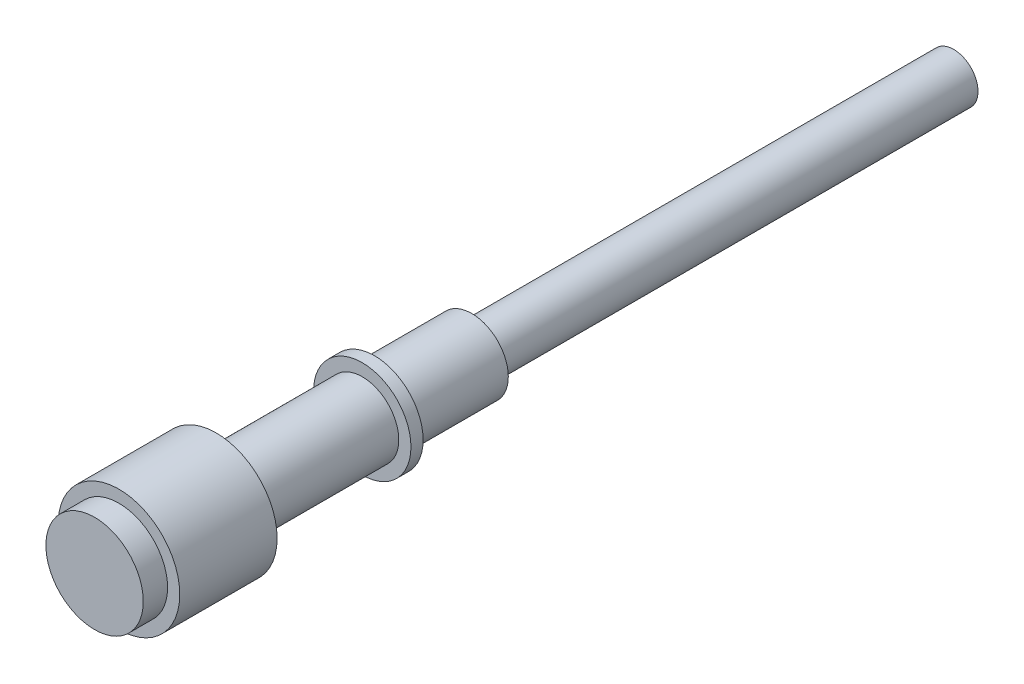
ISO-10303-21;
HEADER;
FILE_DESCRIPTION(('STEP AP214'),'2;1');
FILE_NAME('part.step','',(''),(''),'','','');
FILE_SCHEMA(('AUTOMOTIVE_DESIGN { 1 0 10303 214 1 1 1 1 }'));
ENDSEC;
DATA;
#1=APPLICATION_CONTEXT('core data for automotive mechanical design processes');
#2=APPLICATION_PROTOCOL_DEFINITION('international standard','automotive_design',2000,#1);
#3=PRODUCT_CONTEXT('',#1,'mechanical');
#4=PRODUCT('Part','Part','',(#3));
#5=PRODUCT_RELATED_PRODUCT_CATEGORY('part','',(#4));
#6=PRODUCT_DEFINITION_FORMATION('','',#4);
#7=PRODUCT_DEFINITION_CONTEXT('part definition',#1,'design');
#8=PRODUCT_DEFINITION('design','',#6,#7);
#9=PRODUCT_DEFINITION_SHAPE('','',#8);
#10=(LENGTH_UNIT() NAMED_UNIT(*) SI_UNIT(.MILLI.,.METRE.));
#11=(NAMED_UNIT(*) PLANE_ANGLE_UNIT() SI_UNIT($,.RADIAN.));
#12=(NAMED_UNIT(*) SI_UNIT($,.STERADIAN.) SOLID_ANGLE_UNIT());
#13=UNCERTAINTY_MEASURE_WITH_UNIT(LENGTH_MEASURE(1.E-05),#10,'distance_accuracy_value','');
#14=(GEOMETRIC_REPRESENTATION_CONTEXT(3) GLOBAL_UNCERTAINTY_ASSIGNED_CONTEXT((#13)) GLOBAL_UNIT_ASSIGNED_CONTEXT((#10,
#11,#12)) REPRESENTATION_CONTEXT('',''));
#15=CARTESIAN_POINT('',(0.,0.,0.));
#16=DIRECTION('',(0.,0.,1.));
#17=DIRECTION('',(1.,0.,0.));
#18=AXIS2_PLACEMENT_3D('',#15,#16,#17);
#19=CARTESIAN_POINT('',(0.,0.,125.73));
#20=DIRECTION('',(0.,0.,-1.));
#21=DIRECTION('',(-1.,0.,0.));
#22=AXIS2_PLACEMENT_3D('',#19,#20,#21);
#23=CYLINDRICAL_SURFACE('',#22,6.35);
#24=CARTESIAN_POINT('',(0.,0.,125.73));
#25=DIRECTION('',(0.,0.,1.));
#26=DIRECTION('',(1.,0.,0.));
#27=AXIS2_PLACEMENT_3D('',#24,#25,#26);
#28=CIRCLE('',#27,6.35);
#29=CARTESIAN_POINT('',(6.35,0.,125.73));
#30=VERTEX_POINT('',#29);
#31=EDGE_CURVE('E55',#30,#30,#28,.T.);
#32=ORIENTED_EDGE('',*,*,#31,.F.);
#33=EDGE_LOOP('',(#32));
#34=FACE_BOUND('',#33,.T.);
#35=CARTESIAN_POINT('',(0.,0.,0.));
#36=DIRECTION('',(0.,0.,1.));
#37=DIRECTION('',(1.,0.,0.));
#38=AXIS2_PLACEMENT_3D('',#35,#36,#37);
#39=CIRCLE('',#38,6.35);
#40=CARTESIAN_POINT('',(6.35,0.,0.));
#41=VERTEX_POINT('',#40);
#42=EDGE_CURVE('E46',#41,#41,#39,.T.);
#43=ORIENTED_EDGE('',*,*,#42,.T.);
#44=EDGE_LOOP('',(#43));
#45=FACE_BOUND('',#44,.T.);
#46=ADVANCED_FACE('F43',(#34,#45),#23,.T.);
#47=CARTESIAN_POINT('',(0.,0.,0.));
#48=DIRECTION('',(0.,0.,1.));
#49=DIRECTION('',(1.,0.,0.));
#50=AXIS2_PLACEMENT_3D('',#47,#48,#49);
#51=PLANE('',#50);
#52=ORIENTED_EDGE('',*,*,#42,.F.);
#53=EDGE_LOOP('',(#52));
#54=FACE_BOUND('',#53,.T.);
#55=ADVANCED_FACE('F87',(#54),#51,.F.);
#56=CARTESIAN_POINT('',(0.,0.,151.13));
#57=DIRECTION('',(0.,0.,-1.));
#58=DIRECTION('',(-1.,0.,0.));
#59=AXIS2_PLACEMENT_3D('',#56,#57,#58);
#60=CYLINDRICAL_SURFACE('',#59,9.525);
#61=CARTESIAN_POINT('',(0.,0.,151.13));
#62=DIRECTION('',(0.,0.,1.));
#63=DIRECTION('',(1.,0.,0.));
#64=AXIS2_PLACEMENT_3D('',#61,#62,#63);
#65=CIRCLE('',#64,9.525);
#66=CARTESIAN_POINT('',(9.525,0.,151.13));
#67=VERTEX_POINT('',#66);
#68=EDGE_CURVE('E76',#67,#67,#65,.T.);
#69=ORIENTED_EDGE('',*,*,#68,.F.);
#70=EDGE_LOOP('',(#69));
#71=FACE_BOUND('',#70,.T.);
#72=CARTESIAN_POINT('',(0.,0.,125.73));
#73=DIRECTION('',(0.,0.,1.));
#74=DIRECTION('',(1.,0.,0.));
#75=AXIS2_PLACEMENT_3D('',#72,#73,#74);
#76=CIRCLE('',#75,9.525);
#77=CARTESIAN_POINT('',(9.525,0.,125.73));
#78=VERTEX_POINT('',#77);
#79=EDGE_CURVE('E73',#78,#78,#76,.T.);
#80=ORIENTED_EDGE('',*,*,#79,.T.);
#81=EDGE_LOOP('',(#80));
#82=FACE_BOUND('',#81,.T.);
#83=ADVANCED_FACE('F89',(#71,#82),#60,.T.);
#84=CARTESIAN_POINT('',(0.,0.,125.73));
#85=DIRECTION('',(0.,0.,1.));
#86=DIRECTION('',(1.,0.,0.));
#87=AXIS2_PLACEMENT_3D('',#84,#85,#86);
#88=PLANE('',#87);
#89=ORIENTED_EDGE('',*,*,#31,.T.);
#90=EDGE_LOOP('',(#89));
#91=FACE_BOUND('',#90,.T.);
#92=ORIENTED_EDGE('',*,*,#79,.F.);
#93=EDGE_LOOP('',(#92));
#94=FACE_BOUND('',#93,.T.);
#95=ADVANCED_FACE('F95',(#91,#94),#88,.F.);
#96=CARTESIAN_POINT('',(0.,0.,154.305));
#97=DIRECTION('',(0.,0.,-1.));
#98=DIRECTION('',(-1.,0.,0.));
#99=AXIS2_PLACEMENT_3D('',#96,#97,#98);
#100=CYLINDRICAL_SURFACE('',#99,12.7);
#101=CARTESIAN_POINT('',(0.,0.,154.305));
#102=DIRECTION('',(0.,0.,1.));
#103=DIRECTION('',(1.,0.,0.));
#104=AXIS2_PLACEMENT_3D('',#101,#102,#103);
#105=CIRCLE('',#104,12.7);
#106=CARTESIAN_POINT('',(12.7,0.,154.305));
#107=VERTEX_POINT('',#106);
#108=EDGE_CURVE('E70',#107,#107,#105,.T.);
#109=ORIENTED_EDGE('',*,*,#108,.F.);
#110=EDGE_LOOP('',(#109));
#111=FACE_BOUND('',#110,.T.);
#112=CARTESIAN_POINT('',(0.,0.,151.13));
#113=DIRECTION('',(0.,0.,1.));
#114=DIRECTION('',(1.,0.,0.));
#115=AXIS2_PLACEMENT_3D('',#112,#113,#114);
#116=CIRCLE('',#115,12.7);
#117=CARTESIAN_POINT('',(12.7,0.,151.13));
#118=VERTEX_POINT('',#117);
#119=EDGE_CURVE('E68',#118,#118,#116,.T.);
#120=ORIENTED_EDGE('',*,*,#119,.T.);
#121=EDGE_LOOP('',(#120));
#122=FACE_BOUND('',#121,.T.);
#123=ADVANCED_FACE('F103',(#111,#122),#100,.T.);
#124=CARTESIAN_POINT('',(0.,0.,154.305));
#125=DIRECTION('',(0.,0.,1.));
#126=DIRECTION('',(1.,0.,0.));
#127=AXIS2_PLACEMENT_3D('',#124,#125,#126);
#128=PLANE('',#127);
#129=CARTESIAN_POINT('',(0.,0.,154.305));
#130=DIRECTION('',(0.,0.,1.));
#131=DIRECTION('',(1.,0.,0.));
#132=AXIS2_PLACEMENT_3D('',#129,#130,#131);
#133=CIRCLE('',#132,9.525);
#134=CARTESIAN_POINT('',(-9.525,0.,154.305));
#135=VERTEX_POINT('',#134);
#136=EDGE_CURVE('E50',#135,#135,#133,.T.);
#137=ORIENTED_EDGE('',*,*,#136,.F.);
#138=EDGE_LOOP('',(#137));
#139=FACE_BOUND('',#138,.T.);
#140=ORIENTED_EDGE('',*,*,#108,.T.);
#141=EDGE_LOOP('',(#140));
#142=FACE_BOUND('',#141,.T.);
#143=ADVANCED_FACE('F106',(#139,#142),#128,.T.);
#144=CARTESIAN_POINT('',(0.,0.,151.13));
#145=DIRECTION('',(0.,0.,1.));
#146=DIRECTION('',(1.,0.,0.));
#147=AXIS2_PLACEMENT_3D('',#144,#145,#146);
#148=PLANE('',#147);
#149=ORIENTED_EDGE('',*,*,#68,.T.);
#150=EDGE_LOOP('',(#149));
#151=FACE_BOUND('',#150,.T.);
#152=ORIENTED_EDGE('',*,*,#119,.F.);
#153=EDGE_LOOP('',(#152));
#154=FACE_BOUND('',#153,.T.);
#155=ADVANCED_FACE('F108',(#151,#154),#148,.F.);
#156=CARTESIAN_POINT('',(0.,0.,192.405));
#157=DIRECTION('',(0.,0.,-1.));
#158=DIRECTION('',(-1.,0.,0.));
#159=AXIS2_PLACEMENT_3D('',#156,#157,#158);
#160=CYLINDRICAL_SURFACE('',#159,9.525);
#161=CARTESIAN_POINT('',(0.,0.,192.405));
#162=DIRECTION('',(0.,0.,1.));
#163=DIRECTION('',(1.,0.,0.));
#164=AXIS2_PLACEMENT_3D('',#161,#162,#163);
#165=CIRCLE('',#164,9.525);
#166=CARTESIAN_POINT('',(-9.525,0.,192.405));
#167=VERTEX_POINT('',#166);
#168=EDGE_CURVE('E63',#167,#167,#165,.T.);
#169=CARTESIAN_POINT('',(-9.525,0.,192.405));
#170=CARTESIAN_POINT('',(-9.525,0.,192.008125));
#171=CARTESIAN_POINT('',(-9.525,0.,191.61125));
#172=CARTESIAN_POINT('',(-9.525,0.,190.8175));
#173=CARTESIAN_POINT('',(-9.525,0.,190.420625));
#174=CARTESIAN_POINT('',(-9.525,0.,189.626875));
#175=CARTESIAN_POINT('',(-9.525,0.,189.23));
#176=CARTESIAN_POINT('',(-9.525,0.,188.43625));
#177=CARTESIAN_POINT('',(-9.525,0.,188.039375));
#178=CARTESIAN_POINT('',(-9.525,0.,187.245625));
#179=CARTESIAN_POINT('',(-9.525,0.,186.84875));
#180=CARTESIAN_POINT('',(-9.525,0.,186.055));
#181=CARTESIAN_POINT('',(-9.525,0.,185.658125));
#182=CARTESIAN_POINT('',(-9.525,0.,184.864375));
#183=CARTESIAN_POINT('',(-9.525,0.,184.4675));
#184=CARTESIAN_POINT('',(-9.525,0.,183.67375));
#185=CARTESIAN_POINT('',(-9.525,0.,183.276875));
#186=CARTESIAN_POINT('',(-9.525,0.,182.483125));
#187=CARTESIAN_POINT('',(-9.525,0.,182.08625));
#188=CARTESIAN_POINT('',(-9.525,0.,181.2925));
#189=CARTESIAN_POINT('',(-9.525,0.,180.895625));
#190=CARTESIAN_POINT('',(-9.525,0.,180.101875));
#191=CARTESIAN_POINT('',(-9.525,0.,179.705));
#192=CARTESIAN_POINT('',(-9.525,0.,178.91125));
#193=CARTESIAN_POINT('',(-9.525,0.,178.514375));
#194=CARTESIAN_POINT('',(-9.525,0.,177.720625));
#195=CARTESIAN_POINT('',(-9.525,0.,177.32375));
#196=CARTESIAN_POINT('',(-9.525,0.,176.53));
#197=CARTESIAN_POINT('',(-9.525,0.,176.133125));
#198=CARTESIAN_POINT('',(-9.525,0.,175.339375));
#199=CARTESIAN_POINT('',(-9.525,0.,174.9425));
#200=CARTESIAN_POINT('',(-9.525,0.,174.14875));
#201=CARTESIAN_POINT('',(-9.525,0.,173.751875));
#202=CARTESIAN_POINT('',(-9.525,0.,172.958125));
#203=CARTESIAN_POINT('',(-9.525,0.,172.56125));
#204=CARTESIAN_POINT('',(-9.525,0.,171.7675));
#205=CARTESIAN_POINT('',(-9.525,0.,171.370625));
#206=CARTESIAN_POINT('',(-9.525,0.,170.576875));
#207=CARTESIAN_POINT('',(-9.525,0.,170.18));
#208=CARTESIAN_POINT('',(-9.525,0.,169.38625));
#209=CARTESIAN_POINT('',(-9.525,0.,168.989375));
#210=CARTESIAN_POINT('',(-9.525,0.,168.195625));
#211=CARTESIAN_POINT('',(-9.525,0.,167.79875));
#212=CARTESIAN_POINT('',(-9.525,0.,167.005));
#213=CARTESIAN_POINT('',(-9.525,0.,166.608125));
#214=CARTESIAN_POINT('',(-9.525,0.,165.814375));
#215=CARTESIAN_POINT('',(-9.525,0.,165.4175));
#216=CARTESIAN_POINT('',(-9.525,0.,164.62375));
#217=CARTESIAN_POINT('',(-9.525,0.,164.226875));
#218=CARTESIAN_POINT('',(-9.525,0.,163.433125));
#219=CARTESIAN_POINT('',(-9.525,0.,163.03625));
#220=CARTESIAN_POINT('',(-9.525,0.,162.2425));
#221=CARTESIAN_POINT('',(-9.525,0.,161.845625));
#222=CARTESIAN_POINT('',(-9.525,0.,161.051875));
#223=CARTESIAN_POINT('',(-9.525,0.,160.655));
#224=CARTESIAN_POINT('',(-9.525,0.,159.86125));
#225=CARTESIAN_POINT('',(-9.525,0.,159.464375));
#226=CARTESIAN_POINT('',(-9.525,0.,158.670625));
#227=CARTESIAN_POINT('',(-9.525,0.,158.27375));
#228=CARTESIAN_POINT('',(-9.525,0.,157.48));
#229=CARTESIAN_POINT('',(-9.525,0.,157.083125));
#230=CARTESIAN_POINT('',(-9.525,0.,156.289375));
#231=CARTESIAN_POINT('',(-9.525,0.,155.8925));
#232=CARTESIAN_POINT('',(-9.525,0.,155.09875));
#233=CARTESIAN_POINT('',(-9.525,0.,154.701875));
#234=CARTESIAN_POINT('',(-9.525,0.,154.305));
#235=B_SPLINE_CURVE_WITH_KNOTS('',3,(#169,#170,#171,#172,#173,#174,#175,#176,#177,#178,#179,
#180,#181,#182,#183,#184,#185,#186,#187,#188,#189,#190,#191,#192,#193,#194,#195,#196,#197,#198,
#199,#200,#201,#202,#203,#204,#205,#206,#207,#208,#209,#210,#211,#212,#213,#214,#215,#216,#217,
#218,#219,#220,#221,#222,#223,#224,#225,#226,#227,#228,#229,#230,#231,#232,#233,#234),
.UNSPECIFIED.,.F.,.F.,(4,2,2,2,2,2,2,2,2,2,2,2,2,2,2,2,2,2,2,2,2,2,2,2,2,2,2,2,2,2,2,2,4),(0.,
1.19062499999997,2.38124999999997,3.57187499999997,4.76249999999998,5.95312499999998,
7.14374999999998,8.33437499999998,9.52499999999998,10.715625,11.90625,13.096875,14.2875,
15.478125,16.66875,17.859375,19.05,20.240625,21.43125,22.621875,23.8125,25.003125,26.19375,
27.384375,28.575,29.765625,30.95625,32.146875,33.3375,34.528125,35.71875,36.909375,38.1),.UNSPECIFIED.);
#236=EDGE_CURVE('BSEAM111',#167,#135,#235,.T.);
#237=ORIENTED_EDGE('',*,*,#168,.F.);
#238=ORIENTED_EDGE('',*,*,#136,.T.);
#239=ORIENTED_EDGE('',*,*,#236,.T.);
#240=ORIENTED_EDGE('',*,*,#236,.F.);
#241=EDGE_LOOP('',(#237,#239,#238,#240));
#242=FACE_BOUND('',#241,.T.);
#243=ADVANCED_FACE('F111',(#242),#160,.T.);
#244=CARTESIAN_POINT('',(0.,0.,217.805));
#245=DIRECTION('',(0.,0.,-1.));
#246=DIRECTION('',(-1.,0.,0.));
#247=AXIS2_PLACEMENT_3D('',#244,#245,#246);
#248=CYLINDRICAL_SURFACE('',#247,15.875);
#249=CARTESIAN_POINT('',(0.,0.,217.805));
#250=DIRECTION('',(0.,0.,1.));
#251=DIRECTION('',(1.,0.,0.));
#252=AXIS2_PLACEMENT_3D('',#249,#250,#251);
#253=CIRCLE('',#252,15.875);
#254=CARTESIAN_POINT('',(15.875,0.,217.805));
#255=VERTEX_POINT('',#254);
#256=EDGE_CURVE('E60',#255,#255,#253,.T.);
#257=ORIENTED_EDGE('',*,*,#256,.F.);
#258=EDGE_LOOP('',(#257));
#259=FACE_BOUND('',#258,.T.);
#260=CARTESIAN_POINT('',(0.,0.,192.405));
#261=DIRECTION('',(0.,0.,1.));
#262=DIRECTION('',(1.,0.,0.));
#263=AXIS2_PLACEMENT_3D('',#260,#261,#262);
#264=CIRCLE('',#263,15.875);
#265=CARTESIAN_POINT('',(15.875,0.,192.405));
#266=VERTEX_POINT('',#265);
#267=EDGE_CURVE('E64',#266,#266,#264,.T.);
#268=ORIENTED_EDGE('',*,*,#267,.T.);
#269=EDGE_LOOP('',(#268));
#270=FACE_BOUND('',#269,.T.);
#271=ADVANCED_FACE('F118',(#259,#270),#248,.T.);
#272=CARTESIAN_POINT('',(0.,0.,217.805));
#273=DIRECTION('',(0.,0.,1.));
#274=DIRECTION('',(1.,0.,0.));
#275=AXIS2_PLACEMENT_3D('',#272,#273,#274);
#276=PLANE('',#275);
#277=CARTESIAN_POINT('',(0.,0.,217.805));
#278=DIRECTION('',(0.,0.,1.));
#279=DIRECTION('',(1.,0.,0.));
#280=AXIS2_PLACEMENT_3D('',#277,#278,#279);
#281=CIRCLE('',#280,12.7);
#282=CARTESIAN_POINT('',(12.7,0.,217.805));
#283=VERTEX_POINT('',#282);
#284=EDGE_CURVE('E10',#283,#283,#281,.T.);
#285=ORIENTED_EDGE('',*,*,#284,.F.);
#286=EDGE_LOOP('',(#285));
#287=FACE_BOUND('',#286,.T.);
#288=ORIENTED_EDGE('',*,*,#256,.T.);
#289=EDGE_LOOP('',(#288));
#290=FACE_BOUND('',#289,.T.);
#291=ADVANCED_FACE('F122',(#287,#290),#276,.T.);
#292=CARTESIAN_POINT('',(0.,0.,192.405));
#293=DIRECTION('',(0.,0.,1.));
#294=DIRECTION('',(1.,0.,0.));
#295=AXIS2_PLACEMENT_3D('',#292,#293,#294);
#296=PLANE('',#295);
#297=ORIENTED_EDGE('',*,*,#168,.T.);
#298=EDGE_LOOP('',(#297));
#299=FACE_BOUND('',#298,.T.);
#300=ORIENTED_EDGE('',*,*,#267,.F.);
#301=EDGE_LOOP('',(#300));
#302=FACE_BOUND('',#301,.T.);
#303=ADVANCED_FACE('F124',(#299,#302),#296,.F.);
#304=CARTESIAN_POINT('',(0.,0.,224.155));
#305=DIRECTION('',(0.,0.,-1.));
#306=DIRECTION('',(-1.,0.,0.));
#307=AXIS2_PLACEMENT_3D('',#304,#305,#306);
#308=CYLINDRICAL_SURFACE('',#307,12.7);
#309=CARTESIAN_POINT('',(0.,0.,224.155));
#310=DIRECTION('',(0.,0.,1.));
#311=DIRECTION('',(1.,0.,0.));
#312=AXIS2_PLACEMENT_3D('',#309,#310,#311);
#313=CIRCLE('',#312,12.7);
#314=CARTESIAN_POINT('',(12.7,0.,224.155));
#315=VERTEX_POINT('',#314);
#316=EDGE_CURVE('E59',#315,#315,#313,.T.);
#317=ORIENTED_EDGE('',*,*,#316,.F.);
#318=EDGE_LOOP('',(#317));
#319=FACE_BOUND('',#318,.T.);
#320=ORIENTED_EDGE('',*,*,#284,.T.);
#321=EDGE_LOOP('',(#320));
#322=FACE_BOUND('',#321,.T.);
#323=ADVANCED_FACE('F127',(#319,#322),#308,.T.);
#324=CARTESIAN_POINT('',(0.,0.,224.155));
#325=DIRECTION('',(0.,0.,1.));
#326=DIRECTION('',(1.,0.,0.));
#327=AXIS2_PLACEMENT_3D('',#324,#325,#326);
#328=PLANE('',#327);
#329=ORIENTED_EDGE('',*,*,#316,.T.);
#330=EDGE_LOOP('',(#329));
#331=FACE_BOUND('',#330,.T.);
#332=ADVANCED_FACE('F134',(#331),#328,.T.);
#333=CLOSED_SHELL('',(#46,#55,#83,#95,#123,#143,#155,#243,#271,#291,#303,#323,#332));
#334=MANIFOLD_SOLID_BREP('B2',#333);
#335=ADVANCED_BREP_SHAPE_REPRESENTATION('',(#18,#334),#14);
#336=SHAPE_DEFINITION_REPRESENTATION(#9,#335);
ENDSEC;
END-ISO-10303-21;
